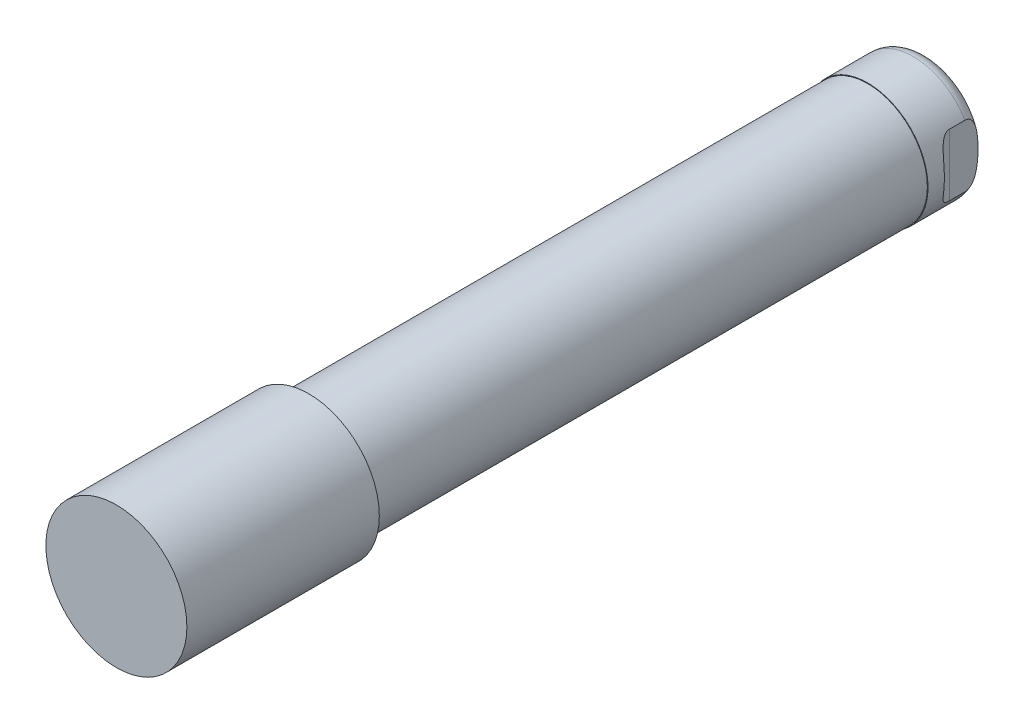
ISO-10303-21;
HEADER;
FILE_DESCRIPTION(('STEP AP214'),'2;1');
FILE_NAME('part.step','',(''),(''),'','','');
FILE_SCHEMA(('AUTOMOTIVE_DESIGN { 1 0 10303 214 1 1 1 1 }'));
ENDSEC;
DATA;
#1=APPLICATION_CONTEXT('core data for automotive mechanical design processes');
#2=APPLICATION_PROTOCOL_DEFINITION('international standard','automotive_design',2000,#1);
#3=PRODUCT_CONTEXT('',#1,'mechanical');
#4=PRODUCT('Part','Part','',(#3));
#5=PRODUCT_RELATED_PRODUCT_CATEGORY('part','',(#4));
#6=PRODUCT_DEFINITION_FORMATION('','',#4);
#7=PRODUCT_DEFINITION_CONTEXT('part definition',#1,'design');
#8=PRODUCT_DEFINITION('design','',#6,#7);
#9=PRODUCT_DEFINITION_SHAPE('','',#8);
#10=(LENGTH_UNIT() NAMED_UNIT(*) SI_UNIT(.MILLI.,.METRE.));
#11=(NAMED_UNIT(*) PLANE_ANGLE_UNIT() SI_UNIT($,.RADIAN.));
#12=(NAMED_UNIT(*) SI_UNIT($,.STERADIAN.) SOLID_ANGLE_UNIT());
#13=UNCERTAINTY_MEASURE_WITH_UNIT(LENGTH_MEASURE(1.E-05),#10,'distance_accuracy_value','');
#14=(GEOMETRIC_REPRESENTATION_CONTEXT(3) GLOBAL_UNCERTAINTY_ASSIGNED_CONTEXT((#13)) GLOBAL_UNIT_ASSIGNED_CONTEXT((#10,
#11,#12)) REPRESENTATION_CONTEXT('',''));
#15=CARTESIAN_POINT('',(0.,0.,0.));
#16=DIRECTION('',(0.,0.,1.));
#17=DIRECTION('',(1.,0.,0.));
#18=AXIS2_PLACEMENT_3D('',#15,#16,#17);
#19=CARTESIAN_POINT('',(0.,0.,0.));
#20=DIRECTION('',(0.,0.,1.));
#21=DIRECTION('',(1.,0.,0.));
#22=AXIS2_PLACEMENT_3D('',#19,#20,#21);
#23=CYLINDRICAL_SURFACE('',#22,12.69238);
#24=CARTESIAN_POINT('',(0.,0.,0.));
#25=DIRECTION('',(0.,0.,1.));
#26=DIRECTION('',(1.,0.,0.));
#27=AXIS2_PLACEMENT_3D('',#24,#25,#26);
#28=CIRCLE('',#27,12.69238);
#29=CARTESIAN_POINT('',(12.69238,0.,0.));
#30=VERTEX_POINT('',#29);
#31=EDGE_CURVE('E29',#30,#30,#28,.T.);
#32=ORIENTED_EDGE('',*,*,#31,.F.);
#33=EDGE_LOOP('',(#32));
#34=FACE_BOUND('',#33,.T.);
#35=CARTESIAN_POINT('',(0.,0.,-118.8974));
#36=DIRECTION('',(0.,0.,1.));
#37=DIRECTION('',(1.,0.,0.));
#38=AXIS2_PLACEMENT_3D('',#35,#36,#37);
#39=CIRCLE('',#38,12.69238);
#40=CARTESIAN_POINT('',(12.69238,0.,-118.8974));
#41=VERTEX_POINT('',#40);
#42=EDGE_CURVE('E10',#41,#41,#39,.T.);
#43=ORIENTED_EDGE('',*,*,#42,.T.);
#44=EDGE_LOOP('',(#43));
#45=FACE_BOUND('',#44,.T.);
#46=ADVANCED_FACE('F16',(#34,#45),#23,.T.);
#47=CARTESIAN_POINT('',(0.,0.,40.937999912));
#48=DIRECTION('',(0.,0.,-1.));
#49=DIRECTION('',(-1.,0.,0.));
#50=AXIS2_PLACEMENT_3D('',#47,#48,#49);
#51=PLANE('',#50);
#52=CARTESIAN_POINT('',(0.,0.,40.937999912));
#53=DIRECTION('',(0.,0.,1.));
#54=DIRECTION('',(1.,0.,0.));
#55=AXIS2_PLACEMENT_3D('',#52,#53,#54);
#56=CIRCLE('',#55,15.);
#57=CARTESIAN_POINT('',(15.,0.,40.937999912));
#58=VERTEX_POINT('',#57);
#59=EDGE_CURVE('E176',#58,#58,#56,.T.);
#60=ORIENTED_EDGE('',*,*,#59,.T.);
#61=EDGE_LOOP('',(#60));
#62=FACE_BOUND('',#61,.T.);
#63=ADVANCED_FACE('F149',(#62),#51,.F.);
#64=CARTESIAN_POINT('',(0.,0.,0.));
#65=DIRECTION('',(0.,0.,1.));
#66=DIRECTION('',(1.,0.,0.));
#67=AXIS2_PLACEMENT_3D('',#64,#65,#66);
#68=CYLINDRICAL_SURFACE('',#67,15.);
#69=ORIENTED_EDGE('',*,*,#59,.F.);
#70=EDGE_LOOP('',(#69));
#71=FACE_BOUND('',#70,.T.);
#72=CARTESIAN_POINT('',(0.,0.,0.));
#73=DIRECTION('',(0.,0.,1.));
#74=DIRECTION('',(1.,0.,0.));
#75=AXIS2_PLACEMENT_3D('',#72,#73,#74);
#76=CIRCLE('',#75,15.);
#77=CARTESIAN_POINT('',(15.,0.,0.));
#78=VERTEX_POINT('',#77);
#79=EDGE_CURVE('E174',#78,#78,#76,.T.);
#80=ORIENTED_EDGE('',*,*,#79,.T.);
#81=EDGE_LOOP('',(#80));
#82=FACE_BOUND('',#81,.T.);
#83=ADVANCED_FACE('F156',(#71,#82),#68,.T.);
#84=CARTESIAN_POINT('',(0.,15.,0.));
#85=DIRECTION('',(0.,0.,1.));
#86=DIRECTION('',(1.,0.,0.));
#87=AXIS2_PLACEMENT_3D('',#84,#85,#86);
#88=PLANE('',#87);
#89=ORIENTED_EDGE('',*,*,#79,.F.);
#90=EDGE_LOOP('',(#89));
#91=FACE_BOUND('',#90,.T.);
#92=ORIENTED_EDGE('',*,*,#31,.T.);
#93=EDGE_LOOP('',(#92));
#94=FACE_BOUND('',#93,.T.);
#95=ADVANCED_FACE('F130',(#91,#94),#88,.F.);
#96=CARTESIAN_POINT('',(0.,0.,-109.858911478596));
#97=DIRECTION('',(0.,0.,-1.));
#98=DIRECTION('',(-1.,0.,0.));
#99=AXIS2_PLACEMENT_3D('',#96,#97,#98);
#100=CONICAL_SURFACE('',#99,0.,1.02974425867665);
#101=CARTESIAN_POINT('',(0.,0.,-113.0974));
#102=DIRECTION('',(0.,0.,1.));
#103=DIRECTION('',(1.,0.,0.));
#104=AXIS2_PLACEMENT_3D('',#101,#102,#103);
#105=CIRCLE('',#104,5.38975);
#106=CARTESIAN_POINT('',(5.38975,0.,-113.0974));
#107=VERTEX_POINT('',#106);
#108=EDGE_CURVE('E92',#107,#107,#105,.T.);
#109=ORIENTED_EDGE('',*,*,#108,.F.);
#110=EDGE_LOOP('',(#109));
#111=FACE_BOUND('',#110,.T.);
#112=CARTESIAN_POINT('',(0.,0.,-109.858911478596));
#113=VERTEX_POINT('',#112);
#114=VERTEX_LOOP('',#113);
#115=FACE_BOUND('',#114,.T.);
#116=ADVANCED_FACE('F126',(#111,#115),#100,.F.);
#117=CARTESIAN_POINT('',(0.,0.,-93.7538097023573));
#118=DIRECTION('',(0.,0.,1.));
#119=DIRECTION('',(1.,0.,0.));
#120=AXIS2_PLACEMENT_3D('',#117,#118,#119);
#121=CYLINDRICAL_SURFACE('',#120,5.38975);
#122=CARTESIAN_POINT('',(0.,0.,-130.89715));
#123=DIRECTION('',(0.,0.,1.));
#124=DIRECTION('',(1.,0.,0.));
#125=AXIS2_PLACEMENT_3D('',#122,#123,#124);
#126=CIRCLE('',#125,5.38975);
#127=CARTESIAN_POINT('',(5.38975,0.,-130.89715));
#128=VERTEX_POINT('',#127);
#129=EDGE_CURVE('E95',#128,#128,#126,.T.);
#130=ORIENTED_EDGE('',*,*,#129,.F.);
#131=EDGE_LOOP('',(#130));
#132=FACE_BOUND('',#131,.T.);
#133=ORIENTED_EDGE('',*,*,#108,.T.);
#134=EDGE_LOOP('',(#133));
#135=FACE_BOUND('',#134,.T.);
#136=ADVANCED_FACE('F129',(#132,#135),#121,.F.);
#137=CARTESIAN_POINT('',(0.,0.,-130.89715));
#138=DIRECTION('',(0.,0.,-1.));
#139=DIRECTION('',(-1.,0.,0.));
#140=AXIS2_PLACEMENT_3D('',#137,#138,#139);
#141=CONICAL_SURFACE('',#140,5.38975,0.785398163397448);
#142=CARTESIAN_POINT('',(0.,0.,-131.5974));
#143=DIRECTION('',(0.,0.,1.));
#144=DIRECTION('',(1.,0.,0.));
#145=AXIS2_PLACEMENT_3D('',#142,#143,#144);
#146=CIRCLE('',#145,6.09);
#147=CARTESIAN_POINT('',(6.09,0.,-131.5974));
#148=VERTEX_POINT('',#147);
#149=EDGE_CURVE('E98',#148,#148,#146,.T.);
#150=ORIENTED_EDGE('',*,*,#149,.F.);
#151=EDGE_LOOP('',(#150));
#152=FACE_BOUND('',#151,.T.);
#153=ORIENTED_EDGE('',*,*,#129,.T.);
#154=EDGE_LOOP('',(#153));
#155=FACE_BOUND('',#154,.T.);
#156=ADVANCED_FACE('F134',(#152,#155),#141,.F.);
#157=CARTESIAN_POINT('',(0.,9.827,-131.5974));
#158=DIRECTION('',(0.,0.,1.));
#159=DIRECTION('',(1.,0.,0.));
#160=AXIS2_PLACEMENT_3D('',#157,#158,#159);
#161=PLANE('',#160);
#162=CARTESIAN_POINT('',(0.,0.,-131.5974));
#163=DIRECTION('',(0.,0.,1.));
#164=DIRECTION('',(1.,0.,0.));
#165=AXIS2_PLACEMENT_3D('',#162,#163,#164);
#166=CIRCLE('',#165,9.827);
#167=CARTESIAN_POINT('',(9.827,0.,-131.5974));
#168=VERTEX_POINT('',#167);
#169=EDGE_CURVE('E101',#168,#168,#166,.T.);
#170=ORIENTED_EDGE('',*,*,#169,.F.);
#171=EDGE_LOOP('',(#170));
#172=FACE_BOUND('',#171,.T.);
#173=ORIENTED_EDGE('',*,*,#149,.T.);
#174=EDGE_LOOP('',(#173));
#175=FACE_BOUND('',#174,.T.);
#176=ADVANCED_FACE('F137',(#172,#175),#161,.F.);
#177=CARTESIAN_POINT('',(14.175,-13.589,-125.2474));
#178=DIRECTION('',(0.,1.,0.));
#179=DIRECTION('',(0.,0.,1.));
#180=AXIS2_PLACEMENT_3D('',#177,#178,#179);
#181=CYLINDRICAL_SURFACE('',#180,3.175);
#182=DIRECTION('',(0.,1.,0.));
#183=VECTOR('',#182,1.);
#184=CARTESIAN_POINT('',(11.,-13.589,-125.2474));
#185=LINE('',#184,#183);
#186=CARTESIAN_POINT('',(11.,-6.59787306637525,-125.2474));
#187=VERTEX_POINT('',#186);
#188=CARTESIAN_POINT('',(11.,6.59787306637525,-125.2474));
#189=VERTEX_POINT('',#188);
#190=EDGE_CURVE('E70',#187,#189,#185,.T.);
#191=ORIENTED_EDGE('',*,*,#190,.T.);
#192=CARTESIAN_POINT('',(12.827,0.,-128.122034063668));
#193=CARTESIAN_POINT('',(12.8270006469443,-0.268706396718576,-128.122032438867));
#194=CARTESIAN_POINT('',(12.8185521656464,-0.537405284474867,-128.118117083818));
#195=CARTESIAN_POINT('',(12.7848168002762,-1.07356137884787,-128.101935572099));
#196=CARTESIAN_POINT('',(12.7595266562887,-1.34101833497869,-128.089667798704));
#197=CARTESIAN_POINT('',(12.6924264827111,-1.87235964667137,-128.055249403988));
#198=CARTESIAN_POINT('',(12.6506688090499,-2.13625260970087,-128.033130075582));
#199=CARTESIAN_POINT('',(12.551075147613,-2.65955990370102,-127.976285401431));
#200=CARTESIAN_POINT('',(12.4932481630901,-2.91897665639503,-127.941567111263));
#201=CARTESIAN_POINT('',(12.3955653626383,-3.30135352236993,-127.87717195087));
#202=CARTESIAN_POINT('',(12.3614412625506,-3.42688052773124,-127.853847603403));
#203=CARTESIAN_POINT('',(12.2896809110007,-3.67592818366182,-127.802425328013));
#204=CARTESIAN_POINT('',(12.2520453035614,-3.79944919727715,-127.774328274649));
#205=CARTESIAN_POINT('',(12.1733916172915,-4.04438579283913,-127.712495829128));
#206=CARTESIAN_POINT('',(12.1323645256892,-4.16579465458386,-127.678745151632));
#207=CARTESIAN_POINT('',(12.0473665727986,-4.40557163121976,-127.604724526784));
#208=CARTESIAN_POINT('',(12.0033958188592,-4.52393985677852,-127.564454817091));
#209=CARTESIAN_POINT('',(11.9123351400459,-4.75859923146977,-127.475645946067));
#210=CARTESIAN_POINT('',(11.8652086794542,-4.87483370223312,-127.426993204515));
#211=CARTESIAN_POINT('',(11.7691575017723,-5.10236285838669,-127.320488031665));
#212=CARTESIAN_POINT('',(11.7202319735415,-5.21365526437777,-127.262631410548));
#213=CARTESIAN_POINT('',(11.621957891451,-5.42917747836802,-127.136568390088));
#214=CARTESIAN_POINT('',(11.5726129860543,-5.53344179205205,-127.068418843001));
#215=CARTESIAN_POINT('',(11.4748714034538,-5.73337583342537,-126.920065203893));
#216=CARTESIAN_POINT('',(11.4264734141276,-5.82905822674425,-126.839879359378));
#217=CARTESIAN_POINT('',(11.3379215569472,-5.99930417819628,-126.675456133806));
#218=CARTESIAN_POINT('',(11.2974443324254,-6.07503291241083,-126.592615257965));
#219=CARTESIAN_POINT('',(11.2211290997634,-6.21486401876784,-126.41554189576));
#220=CARTESIAN_POINT('',(11.1852916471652,-6.2789649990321,-126.321308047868));
#221=CARTESIAN_POINT('',(11.1206016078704,-6.39284793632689,-126.120611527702));
#222=CARTESIAN_POINT('',(11.0918341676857,-6.44245658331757,-126.01402058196));
#223=CARTESIAN_POINT('',(11.0449485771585,-6.52251798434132,-125.791669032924));
#224=CARTESIAN_POINT('',(11.0268129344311,-6.55300220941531,-125.675923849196));
#225=CARTESIAN_POINT('',(11.0050476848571,-6.58948010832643,-125.454354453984));
#226=CARTESIAN_POINT('',(10.9998823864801,-6.59806860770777,-125.34910976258));
#227=CARTESIAN_POINT('',(11.0001214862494,-6.59767106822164,-125.138676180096));
#228=CARTESIAN_POINT('',(11.0055222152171,-6.5886911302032,-125.033487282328));
#229=CARTESIAN_POINT('',(11.0249837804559,-6.55606201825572,-124.839506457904));
#230=CARTESIAN_POINT('',(11.0379211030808,-6.53431349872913,-124.750267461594));
#231=CARTESIAN_POINT('',(11.0703780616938,-6.47917273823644,-124.576769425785));
#232=CARTESIAN_POINT('',(11.0898991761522,-6.44577788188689,-124.492511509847));
#233=CARTESIAN_POINT('',(11.142561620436,-6.35444350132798,-124.29957879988));
#234=CARTESIAN_POINT('',(11.1780628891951,-6.29199722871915,-124.19368729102));
#235=CARTESIAN_POINT('',(11.2555606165,-6.15228870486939,-123.99481926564));
#236=CARTESIAN_POINT('',(11.2975704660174,-6.07499582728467,-123.901870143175));
#237=CARTESIAN_POINT('',(11.3740280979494,-5.93028966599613,-123.750595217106));
#238=CARTESIAN_POINT('',(11.4076958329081,-5.86533333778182,-123.689463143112));
#239=CARTESIAN_POINT('',(11.4761103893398,-5.73031794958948,-123.573738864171));
#240=CARTESIAN_POINT('',(11.5108577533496,-5.66025629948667,-123.519150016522));
#241=CARTESIAN_POINT('',(11.580721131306,-5.51591033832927,-123.415943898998));
#242=CARTESIAN_POINT('',(11.6158375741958,-5.44162053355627,-123.367334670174));
#243=CARTESIAN_POINT('',(11.6858415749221,-5.2896172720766,-123.275588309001));
#244=CARTESIAN_POINT('',(11.7207290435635,-5.21190256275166,-123.232453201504));
#245=CARTESIAN_POINT('',(11.8154406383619,-4.99498140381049,-123.120954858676));
#246=CARTESIAN_POINT('',(11.8745797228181,-4.85289540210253,-123.057592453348));
#247=CARTESIAN_POINT('',(11.9891935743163,-4.56241341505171,-122.943181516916));
#248=CARTESIAN_POINT('',(12.0446655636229,-4.41401278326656,-122.8921422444));
#249=CARTESIAN_POINT('',(12.1510125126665,-4.11223366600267,-122.8001470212));
#250=CARTESIAN_POINT('',(12.2018792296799,-3.958846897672,-122.759208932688));
#251=CARTESIAN_POINT('',(12.2982733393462,-3.64840228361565,-122.685722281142));
#252=CARTESIAN_POINT('',(12.3437989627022,-3.49134324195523,-122.653176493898));
#253=CARTESIAN_POINT('',(12.4233553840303,-3.19567884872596,-122.598936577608));
#254=CARTESIAN_POINT('',(12.4581089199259,-3.05742452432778,-122.576372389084));
#255=CARTESIAN_POINT('',(12.5231131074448,-2.77920652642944,-122.535692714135));
#256=CARTESIAN_POINT('',(12.553363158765,-2.63924262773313,-122.517577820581));
#257=CARTESIAN_POINT('',(12.6371794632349,-2.21717598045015,-122.468915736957));
#258=CARTESIAN_POINT('',(12.6837855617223,-1.93299577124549,-122.444067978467));
#259=CARTESIAN_POINT('',(12.7578770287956,-1.36086538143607,-122.405904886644));
#260=CARTESIAN_POINT('',(12.7853224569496,-1.0729085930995,-122.392613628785));
#261=CARTESIAN_POINT('',(12.8206829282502,-0.495595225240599,-122.375669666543));
#262=CARTESIAN_POINT('',(12.8286032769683,-0.206239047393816,-122.372014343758));
#263=CARTESIAN_POINT('',(12.8247765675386,0.385076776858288,-122.373808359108));
#264=CARTESIAN_POINT('',(12.8121465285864,0.687029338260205,-122.379666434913));
#265=CARTESIAN_POINT('',(12.76563105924,1.28908038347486,-122.402228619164));
#266=CARTESIAN_POINT('',(12.7317365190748,1.58917801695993,-122.418937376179));
#267=CARTESIAN_POINT('',(12.6653524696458,2.0355131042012,-122.454161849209));
#268=CARTESIAN_POINT('',(12.640698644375,2.18336505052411,-122.467560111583));
#269=CARTESIAN_POINT('',(12.5863116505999,2.47771503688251,-122.498276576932));
#270=CARTESIAN_POINT('',(12.5565791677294,2.62421325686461,-122.515594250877));
#271=CARTESIAN_POINT('',(12.4921854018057,2.9153814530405,-122.554784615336));
#272=CARTESIAN_POINT('',(12.4575282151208,3.06005284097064,-122.576653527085));
#273=CARTESIAN_POINT('',(12.3834551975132,3.34722888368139,-122.625764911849));
#274=CARTESIAN_POINT('',(12.3440405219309,3.48973405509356,-122.653006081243));
#275=CARTESIAN_POINT('',(12.2718676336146,3.73427642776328,-122.705720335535));
#276=CARTESIAN_POINT('',(12.2401497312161,3.8369403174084,-122.729716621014));
#277=CARTESIAN_POINT('',(12.1744548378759,4.04054657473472,-122.781594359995));
#278=CARTESIAN_POINT('',(12.1404780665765,4.14148910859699,-122.809475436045));
#279=CARTESIAN_POINT('',(12.0704124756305,4.34146410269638,-122.869696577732));
#280=CARTESIAN_POINT('',(12.0343208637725,4.44049379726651,-122.902042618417));
#281=CARTESIAN_POINT('',(11.9603330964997,4.63608580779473,-122.971776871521));
#282=CARTESIAN_POINT('',(11.9224369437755,4.73264812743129,-123.009165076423));
#283=CARTESIAN_POINT('',(11.8448111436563,4.92372983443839,-123.090082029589));
#284=CARTESIAN_POINT('',(11.8050669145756,5.0182190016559,-123.133668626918));
#285=CARTESIAN_POINT('',(11.724597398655,5.20345470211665,-123.227505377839));
#286=CARTESIAN_POINT('',(11.6838718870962,5.29420036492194,-123.277757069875));
#287=CARTESIAN_POINT('',(11.6022467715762,5.47076103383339,-123.385645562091));
#288=CARTESIAN_POINT('',(11.5613479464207,5.55658882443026,-123.443261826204));
#289=CARTESIAN_POINT('',(11.4802322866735,5.72229837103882,-123.566831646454));
#290=CARTESIAN_POINT('',(11.4400149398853,5.802184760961,-123.632778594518));
#291=CARTESIAN_POINT('',(11.3572443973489,5.96271064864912,-123.781494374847));
#292=CARTESIAN_POINT('',(11.3149050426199,6.0425074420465,-123.865309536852));
#293=CARTESIAN_POINT('',(11.2348293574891,6.19012083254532,-124.045033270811));
#294=CARTESIAN_POINT('',(11.1970931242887,6.25793717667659,-124.140942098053));
#295=CARTESIAN_POINT('',(11.128715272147,6.3787552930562,-124.345969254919));
#296=CARTESIAN_POINT('',(11.098168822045,6.43156007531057,-124.455238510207));
#297=CARTESIAN_POINT('',(11.0482516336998,6.51694473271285,-124.683795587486));
#298=CARTESIAN_POINT('',(11.0288594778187,6.54956337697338,-124.803063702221));
#299=CARTESIAN_POINT('',(11.0057736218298,6.58827028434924,-125.029199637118));
#300=CARTESIAN_POINT('',(11.0001989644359,6.59754065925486,-125.135330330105));
#301=CARTESIAN_POINT('',(10.9998120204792,6.59818715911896,-125.347657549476));
#302=CARTESIAN_POINT('',(11.0049956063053,6.58957014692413,-125.453854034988));
#303=CARTESIAN_POINT('',(11.0241644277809,6.55743862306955,-125.648936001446));
#304=CARTESIAN_POINT('',(11.0369358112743,6.53597607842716,-125.738295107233));
#305=CARTESIAN_POINT('',(11.0690932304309,6.48136604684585,-125.912068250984));
#306=CARTESIAN_POINT('',(11.0884805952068,6.44821621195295,-125.996481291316));
#307=CARTESIAN_POINT('',(11.1407633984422,6.35759036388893,-126.189422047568));
#308=CARTESIAN_POINT('',(11.176000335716,6.2956526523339,-126.295213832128));
#309=CARTESIAN_POINT('',(11.2529937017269,6.15697528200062,-126.493968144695));
#310=CARTESIAN_POINT('',(11.294763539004,6.08020510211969,-126.58690352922));
#311=CARTESIAN_POINT('',(11.370782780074,5.93650304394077,-126.73810818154));
#312=CARTESIAN_POINT('',(11.4042410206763,5.87203904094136,-126.799180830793));
#313=CARTESIAN_POINT('',(11.4722553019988,5.73802693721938,-126.914820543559));
#314=CARTESIAN_POINT('',(11.5068118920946,5.66847626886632,-126.969384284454));
#315=CARTESIAN_POINT('',(11.6110663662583,5.45346713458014,-127.124214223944));
#316=CARTESIAN_POINT('',(11.6812870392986,5.30176672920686,-127.215503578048));
#317=CARTESIAN_POINT('',(11.810013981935,5.00778913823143,-127.367785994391));
#318=CARTESIAN_POINT('',(11.8688574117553,4.86684600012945,-127.431173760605));
#319=CARTESIAN_POINT('',(11.9830054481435,4.57859491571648,-127.545730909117));
#320=CARTESIAN_POINT('',(12.0383073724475,4.43128228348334,-127.596891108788));
#321=CARTESIAN_POINT('',(12.1443997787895,4.13168396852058,-127.689168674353));
#322=CARTESIAN_POINT('',(12.1951815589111,3.97938943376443,-127.7302669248));
#323=CARTESIAN_POINT('',(12.2914956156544,3.67112407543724,-127.80410019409));
#324=CARTESIAN_POINT('',(12.3370261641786,3.51515206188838,-127.836832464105));
#325=CARTESIAN_POINT('',(12.4162972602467,3.22289185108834,-127.891176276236));
#326=CARTESIAN_POINT('',(12.4507928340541,3.08697610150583,-127.913708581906));
#327=CARTESIAN_POINT('',(12.5154354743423,2.81346117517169,-127.954413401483));
#328=CARTESIAN_POINT('',(12.5455819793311,2.67586178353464,-127.972585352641));
#329=CARTESIAN_POINT('',(12.6293223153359,2.26091567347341,-128.021521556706));
#330=CARTESIAN_POINT('',(12.6761913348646,1.98151526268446,-128.046689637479));
#331=CARTESIAN_POINT('',(12.7514128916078,1.41916990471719,-128.085672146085));
#332=CARTESIAN_POINT('',(12.7797420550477,1.13622093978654,-128.099472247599));
#333=CARTESIAN_POINT('',(12.8175325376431,0.568844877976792,-128.117652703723));
#334=CARTESIAN_POINT('',(12.8269993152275,0.284418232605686,-128.122035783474));
#335=CARTESIAN_POINT('',(12.827,0.,-128.122034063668));
#336=B_SPLINE_CURVE_WITH_KNOTS('',3,(#192,#193,#194,#195,#196,#197,#198,#199,#200,#201,#202,
#203,#204,#205,#206,#207,#208,#209,#210,#211,#212,#213,#214,#215,#216,#217,#218,#219,#220,#221,
#222,#223,#224,#225,#226,#227,#228,#229,#230,#231,#232,#233,#234,#235,#236,#237,#238,#239,#240,
#241,#242,#243,#244,#245,#246,#247,#248,#249,#250,#251,#252,#253,#254,#255,#256,#257,#258,#259,
#260,#261,#262,#263,#264,#265,#266,#267,#268,#269,#270,#271,#272,#273,#274,#275,#276,#277,#278,
#279,#280,#281,#282,#283,#284,#285,#286,#287,#288,#289,#290,#291,#292,#293,#294,#295,#296,#297,
#298,#299,#300,#301,#302,#303,#304,#305,#306,#307,#308,#309,#310,#311,#312,#313,#314,#315,#316,
#317,#318,#319,#320,#321,#322,#323,#324,#325,#326,#327,#328,#329,#330,#331,#332,#333,#334,#335),
.UNSPECIFIED.,.T.,.F.,(4,2,2,2,2,2,2,2,2,2,2,2,2,2,2,2,2,2,2,2,2,2,2,2,2,2,2,2,2,2,2,2,2,2,2,2,
2,2,2,2,2,2,2,2,2,2,2,2,2,2,2,2,2,2,2,2,2,2,2,2,2,2,2,2,2,2,2,2,2,2,2,4),(0.,0.805944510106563,
1.61204506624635,2.4156031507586,3.21871192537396,3.61506493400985,4.01134539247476,
4.40871507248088,4.80607026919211,5.20930705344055,5.61272792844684,6.01399694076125,
6.41466364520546,6.77161676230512,7.12861257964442,7.48971755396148,7.85022672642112,
8.16546211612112,8.48058805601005,8.75769226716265,9.03485874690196,9.41660872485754,
9.79915482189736,10.0847983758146,10.3705878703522,10.6567575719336,10.9430328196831,
11.4415134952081,11.94036753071,12.4400974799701,12.9399925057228,13.3728240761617,
13.8057132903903,14.6717977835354,15.5396822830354,16.4073309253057,17.3132532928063,
18.2195640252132,18.6709220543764,19.1222191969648,19.5731431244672,20.0239577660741,
20.3541623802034,20.6843349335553,21.0149536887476,21.3455719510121,21.6795075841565,
22.0135204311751,22.3466214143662,22.6794598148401,23.0480879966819,23.4167239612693,
23.7899949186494,24.1625467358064,24.4806188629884,24.7985689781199,25.0757488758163,
25.3529844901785,25.7335319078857,26.114870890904,26.3991682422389,26.6836101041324,
27.2530112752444,27.7484789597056,28.244317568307,28.7410909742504,29.2380273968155,
29.6639465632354,30.0899206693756,30.9421650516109,31.795481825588,32.648551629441),.UNSPECIFIED.);
#337=EDGE_CURVE('E68',#187,#189,#336,.T.);
#338=ORIENTED_EDGE('',*,*,#337,.F.);
#339=EDGE_LOOP('',(#191,#338));
#340=FACE_BOUND('',#339,.T.);
#341=ADVANCED_FACE('F69',(#340),#181,.F.);
#342=CARTESIAN_POINT('',(11.,-13.589,-131.5974));
#343=DIRECTION('',(-1.,0.,0.));
#344=DIRECTION('',(0.,0.,1.));
#345=AXIS2_PLACEMENT_3D('',#342,#343,#344);
#346=PLANE('',#345);
#347=CARTESIAN_POINT('',(11.,0.,-131.358572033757));
#348=CARTESIAN_POINT('',(11.,-0.235247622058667,-131.358566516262));
#349=CARTESIAN_POINT('',(11.,-0.47049326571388,-131.355397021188));
#350=CARTESIAN_POINT('',(11.,-0.940835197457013,-131.342316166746));
#351=CARTESIAN_POINT('',(11.,-1.17593146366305,-131.332403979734));
#352=CARTESIAN_POINT('',(11.,-1.64591775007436,-131.304650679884));
#353=CARTESIAN_POINT('',(11.,-1.8808072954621,-131.286801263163));
#354=CARTESIAN_POINT('',(11.,-2.3496112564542,-131.241173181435));
#355=CARTESIAN_POINT('',(11.,-2.58352588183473,-131.213396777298));
#356=CARTESIAN_POINT('',(11.,-2.99896168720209,-131.15240929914));
#357=CARTESIAN_POINT('',(11.,-3.18084229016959,-131.121683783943));
#358=CARTESIAN_POINT('',(11.,-3.54279949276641,-131.050474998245));
#359=CARTESIAN_POINT('',(11.,-3.72287538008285,-131.009988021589));
#360=CARTESIAN_POINT('',(11.,-4.07918992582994,-130.917145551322));
#361=CARTESIAN_POINT('',(11.,-4.25544154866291,-130.864840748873));
#362=CARTESIAN_POINT('',(11.,-4.60279770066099,-130.745474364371));
#363=CARTESIAN_POINT('',(11.,-4.77390771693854,-130.678429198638));
#364=CARTESIAN_POINT('',(11.,-5.07702851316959,-130.540171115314));
#365=CARTESIAN_POINT('',(11.,-5.21041921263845,-130.472020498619));
#366=CARTESIAN_POINT('',(11.,-5.4691863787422,-130.321256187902));
#367=CARTESIAN_POINT('',(11.,-5.59455136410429,-130.238622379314));
#368=CARTESIAN_POINT('',(11.,-5.83424377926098,-130.055585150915));
#369=CARTESIAN_POINT('',(11.,-5.94841927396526,-129.954978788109));
#370=CARTESIAN_POINT('',(11.,-6.15698920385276,-129.734977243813));
#371=CARTESIAN_POINT('',(11.,-6.25144900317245,-129.615646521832));
#372=CARTESIAN_POINT('',(11.,-6.38205172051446,-129.405902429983));
#373=CARTESIAN_POINT('',(11.,-6.42688252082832,-129.320904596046));
#374=CARTESIAN_POINT('',(11.,-6.50221817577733,-129.144737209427));
#375=CARTESIAN_POINT('',(11.,-6.53273441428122,-129.053572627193));
#376=CARTESIAN_POINT('',(11.,-6.57724977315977,-128.866596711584));
#377=CARTESIAN_POINT('',(11.,-6.59113988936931,-128.770758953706));
#378=CARTESIAN_POINT('',(11.,-6.60075639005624,-128.578173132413));
#379=CARTESIAN_POINT('',(11.,-6.59648730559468,-128.481425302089));
#380=CARTESIAN_POINT('',(11.,-6.57141197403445,-128.299106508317));
#381=CARTESIAN_POINT('',(11.,-6.5521399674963,-128.213317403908));
#382=CARTESIAN_POINT('',(11.,-6.50034463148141,-128.045879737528));
#383=CARTESIAN_POINT('',(11.,-6.4678172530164,-127.964232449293));
#384=CARTESIAN_POINT('',(11.,-6.37860257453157,-127.779986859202));
#385=CARTESIAN_POINT('',(11.,-6.31747124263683,-127.679544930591));
#386=CARTESIAN_POINT('',(11.,-6.17978674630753,-127.489848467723));
#387=CARTESIAN_POINT('',(11.,-6.10319990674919,-127.400619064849));
#388=CARTESIAN_POINT('',(11.,-5.89835405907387,-127.192212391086));
#389=CARTESIAN_POINT('',(11.,-5.76319645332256,-127.079863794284));
#390=CARTESIAN_POINT('',(11.,-5.47762736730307,-126.877113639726));
#391=CARTESIAN_POINT('',(11.,-5.3271955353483,-126.786741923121));
#392=CARTESIAN_POINT('',(11.,-5.03096035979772,-126.63163530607));
#393=CARTESIAN_POINT('',(11.,-4.88596547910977,-126.565322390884));
#394=CARTESIAN_POINT('',(11.,-4.59078239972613,-126.44529633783));
#395=CARTESIAN_POINT('',(11.,-4.44058958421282,-126.391594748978));
#396=CARTESIAN_POINT('',(11.,-4.13619184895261,-126.29449924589));
#397=CARTESIAN_POINT('',(11.,-3.98197150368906,-126.251154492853));
#398=CARTESIAN_POINT('',(11.,-3.67143699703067,-126.173321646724));
#399=CARTESIAN_POINT('',(11.,-3.51512398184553,-126.138828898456));
#400=CARTESIAN_POINT('',(11.,-3.10051431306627,-126.057399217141));
#401=CARTESIAN_POINT('',(11.,-2.84101265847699,-126.016638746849));
#402=CARTESIAN_POINT('',(11.,-2.32008586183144,-125.949670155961));
#403=CARTESIAN_POINT('',(11.,-2.05865958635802,-125.92347144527));
#404=CARTESIAN_POINT('',(11.,-1.53417590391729,-125.882090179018));
#405=CARTESIAN_POINT('',(11.,-1.27111595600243,-125.866940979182));
#406=CARTESIAN_POINT('',(11.,-0.744724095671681,-125.845581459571));
#407=CARTESIAN_POINT('',(11.,-0.48139227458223,-125.839368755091));
#408=CARTESIAN_POINT('',(11.,0.045598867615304,-125.834922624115));
#409=CARTESIAN_POINT('',(11.,0.309258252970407,-125.836697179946));
#410=CARTESIAN_POINT('',(11.,0.836458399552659,-125.848519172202));
#411=CARTESIAN_POINT('',(11.,1.09999912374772,-125.858568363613));
#412=CARTESIAN_POINT('',(11.,1.62584348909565,-125.888418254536));
#413=CARTESIAN_POINT('',(11.,1.8881485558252,-125.908192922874));
#414=CARTESIAN_POINT('',(11.,2.41147381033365,-125.960242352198));
#415=CARTESIAN_POINT('',(11.,2.67249453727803,-125.992511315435));
#416=CARTESIAN_POINT('',(11.,3.09542675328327,-126.058674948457));
#417=CARTESIAN_POINT('',(11.,3.25812392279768,-126.087509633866));
#418=CARTESIAN_POINT('',(11.,3.5819947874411,-126.153201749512));
#419=CARTESIAN_POINT('',(11.,3.74316778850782,-126.190062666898));
#420=CARTESIAN_POINT('',(11.,4.06223074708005,-126.273272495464));
#421=CARTESIAN_POINT('',(11.,4.22013305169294,-126.31957327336));
#422=CARTESIAN_POINT('',(11.,4.53201190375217,-126.423764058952));
#423=CARTESIAN_POINT('',(11.,4.68599115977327,-126.481645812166));
#424=CARTESIAN_POINT('',(11.,4.99410080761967,-126.614047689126));
#425=CARTESIAN_POINT('',(11.,5.14798871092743,-126.689142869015));
#426=CARTESIAN_POINT('',(11.,5.44570190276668,-126.857817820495));
#427=CARTESIAN_POINT('',(11.,5.58952250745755,-126.951406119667));
#428=CARTESIAN_POINT('',(11.,5.83221957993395,-127.138478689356));
#429=CARTESIAN_POINT('',(11.,5.9342026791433,-127.22788521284));
#430=CARTESIAN_POINT('',(11.,6.12294376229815,-127.42156928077));
#431=CARTESIAN_POINT('',(11.,6.20973462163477,-127.525813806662));
#432=CARTESIAN_POINT('',(11.,6.34141679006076,-127.719255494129));
#433=CARTESIAN_POINT('',(11.,6.39130707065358,-127.805029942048));
#434=CARTESIAN_POINT('',(11.,6.4765495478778,-127.983585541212));
#435=CARTESIAN_POINT('',(11.,6.51191150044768,-128.07636194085));
#436=CARTESIAN_POINT('',(11.,6.56556463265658,-128.267596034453));
#437=CARTESIAN_POINT('',(11.,6.58372131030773,-128.366092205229));
#438=CARTESIAN_POINT('',(11.,6.60072658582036,-128.564733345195));
#439=CARTESIAN_POINT('',(11.,6.59958533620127,-128.664877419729));
#440=CARTESIAN_POINT('',(11.,6.57940404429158,-128.851535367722));
#441=CARTESIAN_POINT('',(11.,6.56245104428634,-128.938285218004));
#442=CARTESIAN_POINT('',(11.,6.51486797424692,-129.107916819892));
#443=CARTESIAN_POINT('',(11.,6.48423316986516,-129.190797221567));
#444=CARTESIAN_POINT('',(11.,6.40020486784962,-129.375207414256));
#445=CARTESIAN_POINT('',(11.,6.34274152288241,-129.474877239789));
#446=CARTESIAN_POINT('',(11.,6.21243394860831,-129.663566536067));
#447=CARTESIAN_POINT('',(11.,6.13956118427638,-129.752565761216));
#448=CARTESIAN_POINT('',(11.,5.94530576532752,-129.959340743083));
#449=CARTESIAN_POINT('',(11.,5.81727690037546,-130.070829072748));
#450=CARTESIAN_POINT('',(11.,5.54582767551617,-130.272917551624));
#451=CARTESIAN_POINT('',(11.,5.40237638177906,-130.363474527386));
#452=CARTESIAN_POINT('',(11.,5.12144094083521,-130.518333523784));
#453=CARTESIAN_POINT('',(11.,4.98490407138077,-130.584391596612));
#454=CARTESIAN_POINT('',(11.,4.70661680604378,-130.704584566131));
#455=CARTESIAN_POINT('',(11.,4.56486202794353,-130.75870916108));
#456=CARTESIAN_POINT('',(11.,4.2776557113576,-130.856997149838));
#457=CARTESIAN_POINT('',(11.,4.13219693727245,-130.901139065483));
#458=CARTESIAN_POINT('',(11.,3.83894997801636,-130.980964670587));
#459=CARTESIAN_POINT('',(11.,3.69116092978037,-131.016645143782));
#460=CARTESIAN_POINT('',(11.,3.39760623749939,-131.080129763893));
#461=CARTESIAN_POINT('',(11.,3.25187625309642,-131.108101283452));
#462=CARTESIAN_POINT('',(11.,2.95942360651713,-131.158332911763));
#463=CARTESIAN_POINT('',(11.,2.81270078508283,-131.1805920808));
#464=CARTESIAN_POINT('',(11.,2.51851404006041,-131.220289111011));
#465=CARTESIAN_POINT('',(11.,2.3710496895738,-131.237723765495));
#466=CARTESIAN_POINT('',(11.,2.07568722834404,-131.268468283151));
#467=CARTESIAN_POINT('',(11.,1.92778908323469,-131.281777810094));
#468=CARTESIAN_POINT('',(11.,1.48370488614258,-131.316420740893));
#469=CARTESIAN_POINT('',(11.,1.18710469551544,-131.332471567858));
#470=CARTESIAN_POINT('',(11.,0.593668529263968,-131.353548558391));
#471=CARTESIAN_POINT('',(11.,0.296832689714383,-131.358578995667));
#472=CARTESIAN_POINT('',(11.,0.,-131.358572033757));
#473=B_SPLINE_CURVE_WITH_KNOTS('',3,(#347,#348,#349,#350,#351,#352,#353,#354,#355,#356,#357,
#358,#359,#360,#361,#362,#363,#364,#365,#366,#367,#368,#369,#370,#371,#372,#373,#374,#375,#376,
#377,#378,#379,#380,#381,#382,#383,#384,#385,#386,#387,#388,#389,#390,#391,#392,#393,#394,#395,
#396,#397,#398,#399,#400,#401,#402,#403,#404,#405,#406,#407,#408,#409,#410,#411,#412,#413,#414,
#415,#416,#417,#418,#419,#420,#421,#422,#423,#424,#425,#426,#427,#428,#429,#430,#431,#432,#433,
#434,#435,#436,#437,#438,#439,#440,#441,#442,#443,#444,#445,#446,#447,#448,#449,#450,#451,#452,
#453,#454,#455,#456,#457,#458,#459,#460,#461,#462,#463,#464,#465,#466,#467,#468,#469,#470,#471,
#472),.UNSPECIFIED.,.T.,.F.,(4,2,2,2,2,2,2,2,2,2,2,2,2,2,2,2,2,2,2,2,2,2,2,2,2,2,2,2,2,2,2,2,2,
2,2,2,2,2,2,2,2,2,2,2,2,2,2,2,2,2,2,2,2,2,2,2,2,2,2,2,2,2,4),(0.,0.705716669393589,
1.41151997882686,2.1180634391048,2.82444608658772,3.37761348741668,3.93099124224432,
4.48203895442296,5.03247604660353,5.48114601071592,5.93044410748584,6.38517954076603,
6.83838254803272,7.12560301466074,7.41259467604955,7.70145778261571,7.99024881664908,
8.25285984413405,8.51555114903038,8.86633809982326,9.21789777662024,9.74220461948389,
10.2672194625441,10.7448305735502,11.2228773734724,11.7031501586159,12.1831698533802,
12.9705914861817,13.7585213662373,14.5488200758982,15.3389078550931,16.129785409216,
16.9208307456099,17.7097702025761,18.4983440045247,18.9938849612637,19.4896416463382,
19.982931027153,20.4758700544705,20.988614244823,21.5015954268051,21.907212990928,
22.3119416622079,22.6085194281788,22.9048977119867,23.2035742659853,23.5020936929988,
23.7660600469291,24.0301178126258,24.3733550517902,24.7172335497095,25.2236859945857,
25.731173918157,26.1855381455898,26.6402930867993,27.0960173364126,27.5519145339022,
27.9969520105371,28.4420626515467,28.887468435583,29.3329105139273,30.223721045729,
31.1141860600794),.UNSPECIFIED.);
#474=CARTESIAN_POINT('',(11.,6.59787306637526,-128.5974));
#475=VERTEX_POINT('',#474);
#476=CARTESIAN_POINT('',(11.,-6.59787306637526,-128.5974));
#477=VERTEX_POINT('',#476);
#478=EDGE_CURVE('E106',#475,#477,#473,.T.);
#479=ORIENTED_EDGE('',*,*,#478,.F.);
#480=DIRECTION('',(0.,0.,1.));
#481=VECTOR('',#480,1.);
#482=CARTESIAN_POINT('',(11.,6.59787306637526,-93.7538097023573));
#483=LINE('',#482,#481);
#484=EDGE_CURVE('E75',#189,#475,#483,.F.);
#485=ORIENTED_EDGE('',*,*,#484,.F.);
#486=ORIENTED_EDGE('',*,*,#190,.F.);
#487=DIRECTION('',(0.,0.,1.));
#488=VECTOR('',#487,1.);
#489=CARTESIAN_POINT('',(11.,-6.59787306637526,-93.7538097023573));
#490=LINE('',#489,#488);
#491=EDGE_CURVE('E37',#477,#187,#490,.T.);
#492=ORIENTED_EDGE('',*,*,#491,.F.);
#493=EDGE_LOOP('',(#479,#485,#486,#492));
#494=FACE_BOUND('',#493,.T.);
#495=ADVANCED_FACE('F74',(#494),#346,.F.);
#496=CARTESIAN_POINT('',(-14.175,-13.589,-125.2474));
#497=DIRECTION('',(0.,1.,0.));
#498=DIRECTION('',(0.,0.,1.));
#499=AXIS2_PLACEMENT_3D('',#496,#497,#498);
#500=CYLINDRICAL_SURFACE('',#499,3.175);
#501=DIRECTION('',(0.,1.,0.));
#502=VECTOR('',#501,1.);
#503=CARTESIAN_POINT('',(-11.,-13.589,-125.2474));
#504=LINE('',#503,#502);
#505=CARTESIAN_POINT('',(-11.,-6.59787306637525,-125.2474));
#506=VERTEX_POINT('',#505);
#507=CARTESIAN_POINT('',(-11.,6.59787306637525,-125.2474));
#508=VERTEX_POINT('',#507);
#509=EDGE_CURVE('E76',#506,#508,#504,.T.);
#510=ORIENTED_EDGE('',*,*,#509,.F.);
#511=CARTESIAN_POINT('',(-12.827,0.,-128.122034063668));
#512=CARTESIAN_POINT('',(-12.8270006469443,0.268706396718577,-128.122032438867));
#513=CARTESIAN_POINT('',(-12.8185521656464,0.537405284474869,-128.118117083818));
#514=CARTESIAN_POINT('',(-12.7848168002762,1.07356137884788,-128.101935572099));
#515=CARTESIAN_POINT('',(-12.7595266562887,1.34101833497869,-128.089667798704));
#516=CARTESIAN_POINT('',(-12.6924264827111,1.87235964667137,-128.055249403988));
#517=CARTESIAN_POINT('',(-12.6506688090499,2.13625260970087,-128.033130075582));
#518=CARTESIAN_POINT('',(-12.551075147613,2.65955990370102,-127.976285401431));
#519=CARTESIAN_POINT('',(-12.4932481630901,2.91897665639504,-127.941567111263));
#520=CARTESIAN_POINT('',(-12.3955653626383,3.30135352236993,-127.87717195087));
#521=CARTESIAN_POINT('',(-12.3614412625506,3.42688052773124,-127.853847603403));
#522=CARTESIAN_POINT('',(-12.2896809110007,3.67592818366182,-127.802425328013));
#523=CARTESIAN_POINT('',(-12.2520453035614,3.79944919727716,-127.774328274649));
#524=CARTESIAN_POINT('',(-12.1733916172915,4.04438579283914,-127.712495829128));
#525=CARTESIAN_POINT('',(-12.1323645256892,4.16579465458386,-127.678745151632));
#526=CARTESIAN_POINT('',(-12.0473665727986,4.40557163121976,-127.604724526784));
#527=CARTESIAN_POINT('',(-12.0033958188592,4.52393985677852,-127.564454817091));
#528=CARTESIAN_POINT('',(-11.9123351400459,4.75859923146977,-127.475645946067));
#529=CARTESIAN_POINT('',(-11.8652086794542,4.87483370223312,-127.426993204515));
#530=CARTESIAN_POINT('',(-11.7691575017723,5.10236285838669,-127.320488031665));
#531=CARTESIAN_POINT('',(-11.7202319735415,5.21365526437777,-127.262631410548));
#532=CARTESIAN_POINT('',(-11.621957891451,5.42917747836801,-127.136568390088));
#533=CARTESIAN_POINT('',(-11.5726129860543,5.53344179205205,-127.068418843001));
#534=CARTESIAN_POINT('',(-11.4748714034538,5.73337583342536,-126.920065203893));
#535=CARTESIAN_POINT('',(-11.4264734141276,5.82905822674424,-126.839879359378));
#536=CARTESIAN_POINT('',(-11.3379215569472,5.9993041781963,-126.675456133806));
#537=CARTESIAN_POINT('',(-11.2974443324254,6.07503291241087,-126.592615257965));
#538=CARTESIAN_POINT('',(-11.2211290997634,6.21486401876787,-126.41554189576));
#539=CARTESIAN_POINT('',(-11.1852916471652,6.27896499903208,-126.321308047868));
#540=CARTESIAN_POINT('',(-11.1206016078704,6.39284793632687,-126.120611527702));
#541=CARTESIAN_POINT('',(-11.0918341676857,6.4424565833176,-126.01402058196));
#542=CARTESIAN_POINT('',(-11.0449485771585,6.52251798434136,-125.791669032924));
#543=CARTESIAN_POINT('',(-11.0268129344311,6.55300220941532,-125.675923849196));
#544=CARTESIAN_POINT('',(-11.0050476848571,6.58948010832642,-125.454354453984));
#545=CARTESIAN_POINT('',(-10.9998823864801,6.59806860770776,-125.34910976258));
#546=CARTESIAN_POINT('',(-11.0001214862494,6.59767106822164,-125.138676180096));
#547=CARTESIAN_POINT('',(-11.0055222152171,6.5886911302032,-125.033487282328));
#548=CARTESIAN_POINT('',(-11.0249837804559,6.55606201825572,-124.839506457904));
#549=CARTESIAN_POINT('',(-11.0379211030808,6.53431349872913,-124.750267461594));
#550=CARTESIAN_POINT('',(-11.0703780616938,6.47917273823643,-124.576769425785));
#551=CARTESIAN_POINT('',(-11.0898991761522,6.44577788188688,-124.492511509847));
#552=CARTESIAN_POINT('',(-11.142561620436,6.35444350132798,-124.29957879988));
#553=CARTESIAN_POINT('',(-11.1780628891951,6.29199722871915,-124.19368729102));
#554=CARTESIAN_POINT('',(-11.2555606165,6.1522887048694,-123.99481926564));
#555=CARTESIAN_POINT('',(-11.2975704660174,6.07499582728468,-123.901870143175));
#556=CARTESIAN_POINT('',(-11.3740280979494,5.93028966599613,-123.750595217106));
#557=CARTESIAN_POINT('',(-11.4076958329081,5.86533333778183,-123.689463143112));
#558=CARTESIAN_POINT('',(-11.4761103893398,5.73031794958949,-123.573738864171));
#559=CARTESIAN_POINT('',(-11.5108577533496,5.66025629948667,-123.519150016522));
#560=CARTESIAN_POINT('',(-11.580721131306,5.51591033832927,-123.415943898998));
#561=CARTESIAN_POINT('',(-11.6158375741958,5.44162053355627,-123.367334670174));
#562=CARTESIAN_POINT('',(-11.6858415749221,5.2896172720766,-123.275588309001));
#563=CARTESIAN_POINT('',(-11.7207290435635,5.21190256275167,-123.232453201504));
#564=CARTESIAN_POINT('',(-11.8154406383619,4.99498140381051,-123.120954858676));
#565=CARTESIAN_POINT('',(-11.8745797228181,4.85289540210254,-123.057592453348));
#566=CARTESIAN_POINT('',(-11.9891935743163,4.56241341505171,-122.943181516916));
#567=CARTESIAN_POINT('',(-12.0446655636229,4.41401278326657,-122.8921422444));
#568=CARTESIAN_POINT('',(-12.1510125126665,4.11223366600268,-122.8001470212));
#569=CARTESIAN_POINT('',(-12.2018792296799,3.95884689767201,-122.759208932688));
#570=CARTESIAN_POINT('',(-12.2982733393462,3.64840228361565,-122.685722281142));
#571=CARTESIAN_POINT('',(-12.3437989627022,3.49134324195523,-122.653176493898));
#572=CARTESIAN_POINT('',(-12.4233553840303,3.19567884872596,-122.598936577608));
#573=CARTESIAN_POINT('',(-12.4581089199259,3.05742452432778,-122.576372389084));
#574=CARTESIAN_POINT('',(-12.5231131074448,2.77920652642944,-122.535692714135));
#575=CARTESIAN_POINT('',(-12.553363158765,2.63924262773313,-122.517577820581));
#576=CARTESIAN_POINT('',(-12.6371794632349,2.21717598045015,-122.468915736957));
#577=CARTESIAN_POINT('',(-12.6837855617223,1.93299577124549,-122.444067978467));
#578=CARTESIAN_POINT('',(-12.7578770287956,1.36086538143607,-122.405904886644));
#579=CARTESIAN_POINT('',(-12.7853224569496,1.0729085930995,-122.392613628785));
#580=CARTESIAN_POINT('',(-12.8206829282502,0.495595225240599,-122.375669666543));
#581=CARTESIAN_POINT('',(-12.8286032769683,0.206239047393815,-122.372014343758));
#582=CARTESIAN_POINT('',(-12.8247765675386,-0.38507677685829,-122.373808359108));
#583=CARTESIAN_POINT('',(-12.8121465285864,-0.687029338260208,-122.379666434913));
#584=CARTESIAN_POINT('',(-12.76563105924,-1.28908038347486,-122.402228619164));
#585=CARTESIAN_POINT('',(-12.7317365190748,-1.58917801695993,-122.418937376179));
#586=CARTESIAN_POINT('',(-12.6653524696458,-2.03551310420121,-122.454161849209));
#587=CARTESIAN_POINT('',(-12.640698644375,-2.18336505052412,-122.467560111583));
#588=CARTESIAN_POINT('',(-12.5863116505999,-2.47771503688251,-122.498276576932));
#589=CARTESIAN_POINT('',(-12.5565791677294,-2.62421325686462,-122.515594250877));
#590=CARTESIAN_POINT('',(-12.4921854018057,-2.91538145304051,-122.554784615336));
#591=CARTESIAN_POINT('',(-12.4575282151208,-3.06005284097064,-122.576653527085));
#592=CARTESIAN_POINT('',(-12.3834551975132,-3.34722888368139,-122.625764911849));
#593=CARTESIAN_POINT('',(-12.3440405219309,-3.48973405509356,-122.653006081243));
#594=CARTESIAN_POINT('',(-12.2718676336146,-3.73427642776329,-122.705720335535));
#595=CARTESIAN_POINT('',(-12.2401497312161,-3.8369403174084,-122.729716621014));
#596=CARTESIAN_POINT('',(-12.1744548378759,-4.04054657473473,-122.781594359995));
#597=CARTESIAN_POINT('',(-12.1404780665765,-4.14148910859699,-122.809475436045));
#598=CARTESIAN_POINT('',(-12.0704124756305,-4.34146410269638,-122.869696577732));
#599=CARTESIAN_POINT('',(-12.0343208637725,-4.44049379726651,-122.902042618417));
#600=CARTESIAN_POINT('',(-11.9603330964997,-4.63608580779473,-122.971776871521));
#601=CARTESIAN_POINT('',(-11.9224369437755,-4.73264812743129,-123.009165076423));
#602=CARTESIAN_POINT('',(-11.8448111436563,-4.92372983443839,-123.090082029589));
#603=CARTESIAN_POINT('',(-11.8050669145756,-5.0182190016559,-123.133668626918));
#604=CARTESIAN_POINT('',(-11.724597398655,-5.20345470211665,-123.227505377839));
#605=CARTESIAN_POINT('',(-11.6838718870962,-5.29420036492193,-123.277757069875));
#606=CARTESIAN_POINT('',(-11.6022467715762,-5.47076103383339,-123.385645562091));
#607=CARTESIAN_POINT('',(-11.5613479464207,-5.55658882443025,-123.443261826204));
#608=CARTESIAN_POINT('',(-11.4802322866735,-5.72229837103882,-123.566831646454));
#609=CARTESIAN_POINT('',(-11.4400149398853,-5.802184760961,-123.632778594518));
#610=CARTESIAN_POINT('',(-11.3572443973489,-5.96271064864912,-123.781494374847));
#611=CARTESIAN_POINT('',(-11.3149050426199,-6.0425074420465,-123.865309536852));
#612=CARTESIAN_POINT('',(-11.2348293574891,-6.19012083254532,-124.045033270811));
#613=CARTESIAN_POINT('',(-11.1970931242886,-6.25793717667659,-124.140942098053));
#614=CARTESIAN_POINT('',(-11.128715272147,-6.3787552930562,-124.345969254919));
#615=CARTESIAN_POINT('',(-11.098168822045,-6.43156007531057,-124.455238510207));
#616=CARTESIAN_POINT('',(-11.0482516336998,-6.51694473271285,-124.683795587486));
#617=CARTESIAN_POINT('',(-11.0288594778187,-6.54956337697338,-124.803063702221));
#618=CARTESIAN_POINT('',(-11.0057736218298,-6.58827028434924,-125.029199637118));
#619=CARTESIAN_POINT('',(-11.0001989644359,-6.59754065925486,-125.135330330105));
#620=CARTESIAN_POINT('',(-10.9998120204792,-6.59818715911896,-125.347657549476));
#621=CARTESIAN_POINT('',(-11.0049956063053,-6.58957014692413,-125.453854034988));
#622=CARTESIAN_POINT('',(-11.0241644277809,-6.55743862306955,-125.648936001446));
#623=CARTESIAN_POINT('',(-11.0369358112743,-6.53597607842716,-125.738295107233));
#624=CARTESIAN_POINT('',(-11.0690932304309,-6.48136604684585,-125.912068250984));
#625=CARTESIAN_POINT('',(-11.0884805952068,-6.44821621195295,-125.996481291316));
#626=CARTESIAN_POINT('',(-11.1407633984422,-6.35759036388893,-126.189422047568));
#627=CARTESIAN_POINT('',(-11.176000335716,-6.29565265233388,-126.295213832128));
#628=CARTESIAN_POINT('',(-11.2529937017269,-6.1569752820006,-126.493968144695));
#629=CARTESIAN_POINT('',(-11.294763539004,-6.08020510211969,-126.58690352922));
#630=CARTESIAN_POINT('',(-11.370782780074,-5.93650304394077,-126.73810818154));
#631=CARTESIAN_POINT('',(-11.4042410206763,-5.87203904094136,-126.799180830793));
#632=CARTESIAN_POINT('',(-11.4722553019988,-5.73802693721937,-126.914820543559));
#633=CARTESIAN_POINT('',(-11.5068118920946,-5.66847626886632,-126.969384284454));
#634=CARTESIAN_POINT('',(-11.6110663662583,-5.45346713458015,-127.124214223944));
#635=CARTESIAN_POINT('',(-11.6812870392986,-5.30176672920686,-127.215503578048));
#636=CARTESIAN_POINT('',(-11.810013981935,-5.00778913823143,-127.367785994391));
#637=CARTESIAN_POINT('',(-11.8688574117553,-4.86684600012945,-127.431173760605));
#638=CARTESIAN_POINT('',(-11.9830054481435,-4.57859491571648,-127.545730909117));
#639=CARTESIAN_POINT('',(-12.0383073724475,-4.43128228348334,-127.596891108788));
#640=CARTESIAN_POINT('',(-12.1443997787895,-4.13168396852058,-127.689168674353));
#641=CARTESIAN_POINT('',(-12.1951815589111,-3.97938943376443,-127.7302669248));
#642=CARTESIAN_POINT('',(-12.2914956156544,-3.67112407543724,-127.80410019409));
#643=CARTESIAN_POINT('',(-12.3370261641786,-3.51515206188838,-127.836832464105));
#644=CARTESIAN_POINT('',(-12.4162972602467,-3.22289185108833,-127.891176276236));
#645=CARTESIAN_POINT('',(-12.4507928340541,-3.08697610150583,-127.913708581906));
#646=CARTESIAN_POINT('',(-12.5154354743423,-2.81346117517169,-127.954413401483));
#647=CARTESIAN_POINT('',(-12.5455819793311,-2.67586178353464,-127.972585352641));
#648=CARTESIAN_POINT('',(-12.6293223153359,-2.26091567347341,-128.021521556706));
#649=CARTESIAN_POINT('',(-12.6761913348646,-1.98151526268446,-128.046689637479));
#650=CARTESIAN_POINT('',(-12.7514128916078,-1.41916990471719,-128.085672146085));
#651=CARTESIAN_POINT('',(-12.7797420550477,-1.13622093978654,-128.099472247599));
#652=CARTESIAN_POINT('',(-12.8175325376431,-0.568844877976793,-128.117652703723));
#653=CARTESIAN_POINT('',(-12.8269993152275,-0.284418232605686,-128.122035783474));
#654=CARTESIAN_POINT('',(-12.827,0.,-128.122034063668));
#655=B_SPLINE_CURVE_WITH_KNOTS('',3,(#511,#512,#513,#514,#515,#516,#517,#518,#519,#520,#521,
#522,#523,#524,#525,#526,#527,#528,#529,#530,#531,#532,#533,#534,#535,#536,#537,#538,#539,#540,
#541,#542,#543,#544,#545,#546,#547,#548,#549,#550,#551,#552,#553,#554,#555,#556,#557,#558,#559,
#560,#561,#562,#563,#564,#565,#566,#567,#568,#569,#570,#571,#572,#573,#574,#575,#576,#577,#578,
#579,#580,#581,#582,#583,#584,#585,#586,#587,#588,#589,#590,#591,#592,#593,#594,#595,#596,#597,
#598,#599,#600,#601,#602,#603,#604,#605,#606,#607,#608,#609,#610,#611,#612,#613,#614,#615,#616,
#617,#618,#619,#620,#621,#622,#623,#624,#625,#626,#627,#628,#629,#630,#631,#632,#633,#634,#635,
#636,#637,#638,#639,#640,#641,#642,#643,#644,#645,#646,#647,#648,#649,#650,#651,#652,#653,#654),
.UNSPECIFIED.,.T.,.F.,(4,2,2,2,2,2,2,2,2,2,2,2,2,2,2,2,2,2,2,2,2,2,2,2,2,2,2,2,2,2,2,2,2,2,2,2,
2,2,2,2,2,2,2,2,2,2,2,2,2,2,2,2,2,2,2,2,2,2,2,2,2,2,2,2,2,2,2,2,2,2,2,4),(0.,0.805944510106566,
1.61204506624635,2.4156031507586,3.21871192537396,3.61506493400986,4.01134539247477,
4.40871507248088,4.80607026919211,5.20930705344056,5.61272792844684,6.01399694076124,
6.41466364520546,6.77161676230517,7.12861257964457,7.48971755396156,7.8502267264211,
8.16546211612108,8.48058805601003,8.75769226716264,9.03485874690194,9.41660872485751,
9.79915482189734,10.0847983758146,10.3705878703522,10.6567575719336,10.9430328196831,
11.4415134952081,11.94036753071,12.44009747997,12.9399925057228,13.3728240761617,
13.8057132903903,14.6717977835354,15.5396822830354,16.4073309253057,17.3132532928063,
18.2195640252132,18.6709220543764,19.1222191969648,19.5731431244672,20.0239577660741,
20.3541623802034,20.6843349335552,21.0149536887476,21.3455719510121,21.6795075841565,
22.0135204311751,22.3466214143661,22.6794598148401,23.0480879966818,23.4167239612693,
23.7899949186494,24.1625467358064,24.4806188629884,24.7985689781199,25.0757488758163,
25.3529844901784,25.7335319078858,26.114870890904,26.3991682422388,26.6836101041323,
27.2530112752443,27.7484789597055,28.244317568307,28.7410909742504,29.2380273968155,
29.6639465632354,30.0899206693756,30.9421650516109,31.795481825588,32.648551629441),.UNSPECIFIED.);
#656=EDGE_CURVE('E20',#508,#506,#655,.T.);
#657=ORIENTED_EDGE('',*,*,#656,.F.);
#658=EDGE_LOOP('',(#510,#657));
#659=FACE_BOUND('',#658,.T.);
#660=ADVANCED_FACE('F124',(#659),#500,.F.);
#661=CARTESIAN_POINT('',(-11.,-13.589,-125.2474));
#662=DIRECTION('',(1.,0.,0.));
#663=DIRECTION('',(0.,0.,-1.));
#664=AXIS2_PLACEMENT_3D('',#661,#662,#663);
#665=PLANE('',#664);
#666=CARTESIAN_POINT('',(-11.,0.,-131.358572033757));
#667=CARTESIAN_POINT('',(-11.,0.235247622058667,-131.358566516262));
#668=CARTESIAN_POINT('',(-11.,0.47049326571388,-131.355397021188));
#669=CARTESIAN_POINT('',(-11.,0.940835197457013,-131.342316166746));
#670=CARTESIAN_POINT('',(-11.,1.17593146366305,-131.332403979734));
#671=CARTESIAN_POINT('',(-11.,1.64591775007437,-131.304650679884));
#672=CARTESIAN_POINT('',(-11.,1.8808072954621,-131.286801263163));
#673=CARTESIAN_POINT('',(-11.,2.3496112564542,-131.241173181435));
#674=CARTESIAN_POINT('',(-11.,2.58352588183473,-131.213396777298));
#675=CARTESIAN_POINT('',(-11.,2.99896168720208,-131.15240929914));
#676=CARTESIAN_POINT('',(-11.,3.18084229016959,-131.121683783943));
#677=CARTESIAN_POINT('',(-11.,3.54279949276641,-131.050474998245));
#678=CARTESIAN_POINT('',(-11.,3.72287538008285,-131.009988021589));
#679=CARTESIAN_POINT('',(-11.,4.07918992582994,-130.917145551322));
#680=CARTESIAN_POINT('',(-11.,4.2554415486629,-130.864840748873));
#681=CARTESIAN_POINT('',(-11.,4.60279770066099,-130.745474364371));
#682=CARTESIAN_POINT('',(-11.,4.77390771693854,-130.678429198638));
#683=CARTESIAN_POINT('',(-11.,5.07702851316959,-130.540171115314));
#684=CARTESIAN_POINT('',(-11.,5.21041921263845,-130.472020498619));
#685=CARTESIAN_POINT('',(-11.,5.4691863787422,-130.321256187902));
#686=CARTESIAN_POINT('',(-11.,5.59455136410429,-130.238622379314));
#687=CARTESIAN_POINT('',(-11.,5.83424377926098,-130.055585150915));
#688=CARTESIAN_POINT('',(-11.,5.94841927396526,-129.954978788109));
#689=CARTESIAN_POINT('',(-11.,6.15698920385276,-129.734977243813));
#690=CARTESIAN_POINT('',(-11.,6.25144900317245,-129.615646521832));
#691=CARTESIAN_POINT('',(-11.,6.38205172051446,-129.405902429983));
#692=CARTESIAN_POINT('',(-11.,6.42688252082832,-129.320904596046));
#693=CARTESIAN_POINT('',(-11.,6.50221817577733,-129.144737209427));
#694=CARTESIAN_POINT('',(-11.,6.53273441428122,-129.053572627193));
#695=CARTESIAN_POINT('',(-11.,6.57724977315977,-128.866596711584));
#696=CARTESIAN_POINT('',(-11.,6.59113988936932,-128.770758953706));
#697=CARTESIAN_POINT('',(-11.,6.60075639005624,-128.578173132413));
#698=CARTESIAN_POINT('',(-11.,6.59648730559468,-128.481425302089));
#699=CARTESIAN_POINT('',(-11.,6.57141197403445,-128.299106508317));
#700=CARTESIAN_POINT('',(-11.,6.5521399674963,-128.213317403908));
#701=CARTESIAN_POINT('',(-11.,6.50034463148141,-128.045879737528));
#702=CARTESIAN_POINT('',(-11.,6.4678172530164,-127.964232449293));
#703=CARTESIAN_POINT('',(-11.,6.37860257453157,-127.779986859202));
#704=CARTESIAN_POINT('',(-11.,6.31747124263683,-127.679544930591));
#705=CARTESIAN_POINT('',(-11.,6.17978674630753,-127.489848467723));
#706=CARTESIAN_POINT('',(-11.,6.10319990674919,-127.400619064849));
#707=CARTESIAN_POINT('',(-11.,5.89835405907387,-127.192212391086));
#708=CARTESIAN_POINT('',(-11.,5.76319645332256,-127.079863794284));
#709=CARTESIAN_POINT('',(-11.,5.47762736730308,-126.877113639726));
#710=CARTESIAN_POINT('',(-11.,5.32719553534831,-126.786741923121));
#711=CARTESIAN_POINT('',(-11.,5.03096035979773,-126.63163530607));
#712=CARTESIAN_POINT('',(-11.,4.88596547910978,-126.565322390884));
#713=CARTESIAN_POINT('',(-11.,4.59078239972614,-126.44529633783));
#714=CARTESIAN_POINT('',(-11.,4.44058958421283,-126.391594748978));
#715=CARTESIAN_POINT('',(-11.,4.13619184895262,-126.29449924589));
#716=CARTESIAN_POINT('',(-11.,3.98197150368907,-126.251154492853));
#717=CARTESIAN_POINT('',(-11.,3.67143699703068,-126.173321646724));
#718=CARTESIAN_POINT('',(-11.,3.51512398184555,-126.138828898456));
#719=CARTESIAN_POINT('',(-11.,3.10051431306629,-126.057399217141));
#720=CARTESIAN_POINT('',(-11.,2.84101265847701,-126.016638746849));
#721=CARTESIAN_POINT('',(-11.,2.32008586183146,-125.949670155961));
#722=CARTESIAN_POINT('',(-11.,2.05865958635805,-125.92347144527));
#723=CARTESIAN_POINT('',(-11.,1.53417590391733,-125.882090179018));
#724=CARTESIAN_POINT('',(-11.,1.27111595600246,-125.866940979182));
#725=CARTESIAN_POINT('',(-11.,0.744724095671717,-125.845581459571));
#726=CARTESIAN_POINT('',(-11.,0.481392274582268,-125.839368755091));
#727=CARTESIAN_POINT('',(-11.,-0.0455988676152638,-125.834922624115));
#728=CARTESIAN_POINT('',(-11.,-0.309258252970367,-125.836697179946));
#729=CARTESIAN_POINT('',(-11.,-0.836458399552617,-125.848519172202));
#730=CARTESIAN_POINT('',(-11.,-1.09999912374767,-125.858568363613));
#731=CARTESIAN_POINT('',(-11.,-1.6258434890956,-125.888418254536));
#732=CARTESIAN_POINT('',(-11.,-1.88814855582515,-125.908192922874));
#733=CARTESIAN_POINT('',(-11.,-2.41147381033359,-125.960242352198));
#734=CARTESIAN_POINT('',(-11.,-2.67249453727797,-125.992511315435));
#735=CARTESIAN_POINT('',(-11.,-3.09542675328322,-126.058674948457));
#736=CARTESIAN_POINT('',(-11.,-3.25812392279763,-126.087509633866));
#737=CARTESIAN_POINT('',(-11.,-3.58199478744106,-126.153201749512));
#738=CARTESIAN_POINT('',(-11.,-3.74316778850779,-126.190062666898));
#739=CARTESIAN_POINT('',(-11.,-4.06223074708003,-126.273272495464));
#740=CARTESIAN_POINT('',(-11.,-4.22013305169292,-126.31957327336));
#741=CARTESIAN_POINT('',(-11.,-4.53201190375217,-126.423764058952));
#742=CARTESIAN_POINT('',(-11.,-4.68599115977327,-126.481645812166));
#743=CARTESIAN_POINT('',(-11.,-4.99410080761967,-126.614047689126));
#744=CARTESIAN_POINT('',(-11.,-5.14798871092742,-126.689142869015));
#745=CARTESIAN_POINT('',(-11.,-5.44570190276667,-126.857817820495));
#746=CARTESIAN_POINT('',(-11.,-5.58952250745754,-126.951406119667));
#747=CARTESIAN_POINT('',(-11.,-5.83221957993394,-127.138478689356));
#748=CARTESIAN_POINT('',(-11.,-5.93420267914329,-127.22788521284));
#749=CARTESIAN_POINT('',(-11.,-6.12294376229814,-127.42156928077));
#750=CARTESIAN_POINT('',(-11.,-6.20973462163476,-127.525813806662));
#751=CARTESIAN_POINT('',(-11.,-6.34141679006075,-127.719255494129));
#752=CARTESIAN_POINT('',(-11.,-6.39130707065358,-127.805029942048));
#753=CARTESIAN_POINT('',(-11.,-6.4765495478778,-127.983585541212));
#754=CARTESIAN_POINT('',(-11.,-6.51191150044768,-128.07636194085));
#755=CARTESIAN_POINT('',(-11.,-6.56556463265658,-128.267596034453));
#756=CARTESIAN_POINT('',(-11.,-6.58372131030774,-128.366092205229));
#757=CARTESIAN_POINT('',(-11.,-6.60072658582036,-128.564733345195));
#758=CARTESIAN_POINT('',(-11.,-6.59958533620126,-128.664877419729));
#759=CARTESIAN_POINT('',(-11.,-6.57940404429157,-128.851535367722));
#760=CARTESIAN_POINT('',(-11.,-6.56245104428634,-128.938285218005));
#761=CARTESIAN_POINT('',(-11.,-6.51486797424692,-129.107916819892));
#762=CARTESIAN_POINT('',(-11.,-6.48423316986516,-129.190797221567));
#763=CARTESIAN_POINT('',(-11.,-6.40020486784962,-129.375207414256));
#764=CARTESIAN_POINT('',(-11.,-6.34274152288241,-129.474877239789));
#765=CARTESIAN_POINT('',(-11.,-6.21243394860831,-129.663566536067));
#766=CARTESIAN_POINT('',(-11.,-6.13956118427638,-129.752565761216));
#767=CARTESIAN_POINT('',(-11.,-5.94530576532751,-129.959340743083));
#768=CARTESIAN_POINT('',(-11.,-5.81727690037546,-130.070829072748));
#769=CARTESIAN_POINT('',(-11.,-5.54582767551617,-130.272917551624));
#770=CARTESIAN_POINT('',(-11.,-5.40237638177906,-130.363474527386));
#771=CARTESIAN_POINT('',(-11.,-5.12144094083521,-130.518333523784));
#772=CARTESIAN_POINT('',(-11.,-4.98490407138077,-130.584391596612));
#773=CARTESIAN_POINT('',(-11.,-4.70661680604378,-130.704584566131));
#774=CARTESIAN_POINT('',(-11.,-4.56486202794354,-130.75870916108));
#775=CARTESIAN_POINT('',(-11.,-4.2776557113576,-130.856997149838));
#776=CARTESIAN_POINT('',(-11.,-4.13219693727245,-130.901139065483));
#777=CARTESIAN_POINT('',(-11.,-3.83894997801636,-130.980964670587));
#778=CARTESIAN_POINT('',(-11.,-3.69116092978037,-131.016645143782));
#779=CARTESIAN_POINT('',(-11.,-3.39760623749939,-131.080129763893));
#780=CARTESIAN_POINT('',(-11.,-3.25187625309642,-131.108101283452));
#781=CARTESIAN_POINT('',(-11.,-2.95942360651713,-131.158332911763));
#782=CARTESIAN_POINT('',(-11.,-2.81270078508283,-131.1805920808));
#783=CARTESIAN_POINT('',(-11.,-2.51851404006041,-131.220289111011));
#784=CARTESIAN_POINT('',(-11.,-2.3710496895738,-131.237723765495));
#785=CARTESIAN_POINT('',(-11.,-2.07568722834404,-131.268468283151));
#786=CARTESIAN_POINT('',(-11.,-1.92778908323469,-131.281777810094));
#787=CARTESIAN_POINT('',(-11.,-1.48370488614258,-131.316420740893));
#788=CARTESIAN_POINT('',(-11.,-1.18710469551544,-131.332471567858));
#789=CARTESIAN_POINT('',(-11.,-0.593668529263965,-131.353548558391));
#790=CARTESIAN_POINT('',(-11.,-0.296832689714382,-131.358578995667));
#791=CARTESIAN_POINT('',(-11.,0.,-131.358572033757));
#792=B_SPLINE_CURVE_WITH_KNOTS('',3,(#666,#667,#668,#669,#670,#671,#672,#673,#674,#675,#676,
#677,#678,#679,#680,#681,#682,#683,#684,#685,#686,#687,#688,#689,#690,#691,#692,#693,#694,#695,
#696,#697,#698,#699,#700,#701,#702,#703,#704,#705,#706,#707,#708,#709,#710,#711,#712,#713,#714,
#715,#716,#717,#718,#719,#720,#721,#722,#723,#724,#725,#726,#727,#728,#729,#730,#731,#732,#733,
#734,#735,#736,#737,#738,#739,#740,#741,#742,#743,#744,#745,#746,#747,#748,#749,#750,#751,#752,
#753,#754,#755,#756,#757,#758,#759,#760,#761,#762,#763,#764,#765,#766,#767,#768,#769,#770,#771,
#772,#773,#774,#775,#776,#777,#778,#779,#780,#781,#782,#783,#784,#785,#786,#787,#788,#789,#790,
#791),.UNSPECIFIED.,.T.,.F.,(4,2,2,2,2,2,2,2,2,2,2,2,2,2,2,2,2,2,2,2,2,2,2,2,2,2,2,2,2,2,2,2,2,
2,2,2,2,2,2,2,2,2,2,2,2,2,2,2,2,2,2,2,2,2,2,2,2,2,2,2,2,2,4),(0.,0.705716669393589,
1.41151997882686,2.1180634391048,2.82444608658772,3.37761348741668,3.93099124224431,
4.48203895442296,5.03247604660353,5.48114601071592,5.93044410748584,6.38517954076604,
6.83838254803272,7.12560301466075,7.41259467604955,7.70145778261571,7.99024881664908,
8.25285984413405,8.51555114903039,8.86633809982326,9.21789777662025,9.74220461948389,
10.2672194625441,10.7448305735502,11.2228773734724,11.7031501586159,12.1831698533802,
12.9705914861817,13.7585213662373,14.5488200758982,15.3389078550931,16.129785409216,
16.9208307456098,17.709770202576,18.4983440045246,18.9938849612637,19.4896416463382,
19.982931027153,20.4758700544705,20.988614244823,21.5015954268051,21.907212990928,
22.3119416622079,22.6085194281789,22.9048977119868,23.2035742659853,23.5020936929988,
23.7660600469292,24.0301178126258,24.3733550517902,24.7172335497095,25.2236859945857,
25.731173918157,26.1855381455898,26.6402930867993,27.0960173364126,27.5519145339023,
27.9969520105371,28.4420626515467,28.887468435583,29.3329105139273,30.223721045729,
31.1141860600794),.UNSPECIFIED.);
#793=CARTESIAN_POINT('',(-11.,-6.59787306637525,-128.5974));
#794=VERTEX_POINT('',#793);
#795=CARTESIAN_POINT('',(-11.,6.59787306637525,-128.5974));
#796=VERTEX_POINT('',#795);
#797=EDGE_CURVE('E73',#794,#796,#792,.T.);
#798=ORIENTED_EDGE('',*,*,#797,.F.);
#799=DIRECTION('',(0.,0.,1.));
#800=VECTOR('',#799,1.);
#801=CARTESIAN_POINT('',(-11.,-6.59787306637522,-93.7538097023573));
#802=LINE('',#801,#800);
#803=EDGE_CURVE('E86',#506,#794,#802,.F.);
#804=ORIENTED_EDGE('',*,*,#803,.F.);
#805=ORIENTED_EDGE('',*,*,#509,.T.);
#806=DIRECTION('',(0.,0.,1.));
#807=VECTOR('',#806,1.);
#808=CARTESIAN_POINT('',(-11.,6.59787306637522,-93.7538097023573));
#809=LINE('',#808,#807);
#810=EDGE_CURVE('E45',#796,#508,#809,.T.);
#811=ORIENTED_EDGE('',*,*,#810,.F.);
#812=EDGE_LOOP('',(#798,#804,#805,#811));
#813=FACE_BOUND('',#812,.T.);
#814=ADVANCED_FACE('F162',(#813),#665,.F.);
#815=CARTESIAN_POINT('',(0.,0.,-128.5974));
#816=DIRECTION('',(0.,0.,1.));
#817=DIRECTION('',(1.,0.,0.));
#818=AXIS2_PLACEMENT_3D('',#815,#816,#817);
#819=TOROIDAL_SURFACE('',#818,9.827,3.);
#820=CARTESIAN_POINT('',(0.,0.,-128.5974));
#821=DIRECTION('',(0.,0.,1.));
#822=DIRECTION('',(1.,0.,0.));
#823=AXIS2_PLACEMENT_3D('',#820,#821,#822);
#824=CIRCLE('',#823,12.827);
#825=EDGE_CURVE('E85',#794,#477,#824,.T.);
#826=ORIENTED_EDGE('',*,*,#825,.F.);
#827=ORIENTED_EDGE('',*,*,#797,.T.);
#828=EDGE_CURVE('E104',#475,#796,#824,.T.);
#829=ORIENTED_EDGE('',*,*,#828,.F.);
#830=ORIENTED_EDGE('',*,*,#478,.T.);
#831=EDGE_LOOP('',(#826,#827,#829,#830));
#832=FACE_BOUND('',#831,.T.);
#833=ORIENTED_EDGE('',*,*,#169,.T.);
#834=EDGE_LOOP('',(#833));
#835=FACE_BOUND('',#834,.T.);
#836=ADVANCED_FACE('F117',(#832,#835),#819,.T.);
#837=CARTESIAN_POINT('',(0.,0.,-93.7538097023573));
#838=DIRECTION('',(0.,0.,1.));
#839=DIRECTION('',(1.,0.,0.));
#840=AXIS2_PLACEMENT_3D('',#837,#838,#839);
#841=CYLINDRICAL_SURFACE('',#840,12.827);
#842=ORIENTED_EDGE('',*,*,#828,.T.);
#843=ORIENTED_EDGE('',*,*,#810,.T.);
#844=ORIENTED_EDGE('',*,*,#656,.T.);
#845=ORIENTED_EDGE('',*,*,#803,.T.);
#846=ORIENTED_EDGE('',*,*,#825,.T.);
#847=ORIENTED_EDGE('',*,*,#491,.T.);
#848=ORIENTED_EDGE('',*,*,#337,.T.);
#849=ORIENTED_EDGE('',*,*,#484,.T.);
#850=EDGE_LOOP('',(#842,#843,#844,#845,#846,#847,#848,#849));
#851=FACE_BOUND('',#850,.T.);
#852=CARTESIAN_POINT('',(0.,0.,-118.8974));
#853=DIRECTION('',(0.,0.,-1.));
#854=DIRECTION('',(-1.,0.,0.));
#855=AXIS2_PLACEMENT_3D('',#852,#853,#854);
#856=CIRCLE('',#855,12.827);
#857=CARTESIAN_POINT('',(-12.827,0.,-118.8974));
#858=VERTEX_POINT('',#857);
#859=EDGE_CURVE('E77',#858,#858,#856,.F.);
#860=ORIENTED_EDGE('',*,*,#859,.F.);
#861=EDGE_LOOP('',(#860));
#862=FACE_BOUND('',#861,.T.);
#863=ADVANCED_FACE('F81',(#851,#862),#841,.T.);
#864=CARTESIAN_POINT('',(0.,9.8171,-118.8974));
#865=DIRECTION('',(0.,0.,-1.));
#866=DIRECTION('',(-1.,0.,0.));
#867=AXIS2_PLACEMENT_3D('',#864,#865,#866);
#868=PLANE('',#867);
#869=ORIENTED_EDGE('',*,*,#42,.F.);
#870=EDGE_LOOP('',(#869));
#871=FACE_BOUND('',#870,.T.);
#872=ORIENTED_EDGE('',*,*,#859,.T.);
#873=EDGE_LOOP('',(#872));
#874=FACE_BOUND('',#873,.T.);
#875=ADVANCED_FACE('F18',(#871,#874),#868,.F.);
#876=CLOSED_SHELL('',(#46,#63,#83,#95,#116,#136,#156,#176,#341,#495,#660,#814,#836,#863,#875));
#877=MANIFOLD_SOLID_BREP('B1',#876);
#878=ADVANCED_BREP_SHAPE_REPRESENTATION('',(#18,#877),#14);
#879=SHAPE_DEFINITION_REPRESENTATION(#9,#878);
ENDSEC;
END-ISO-10303-21;
